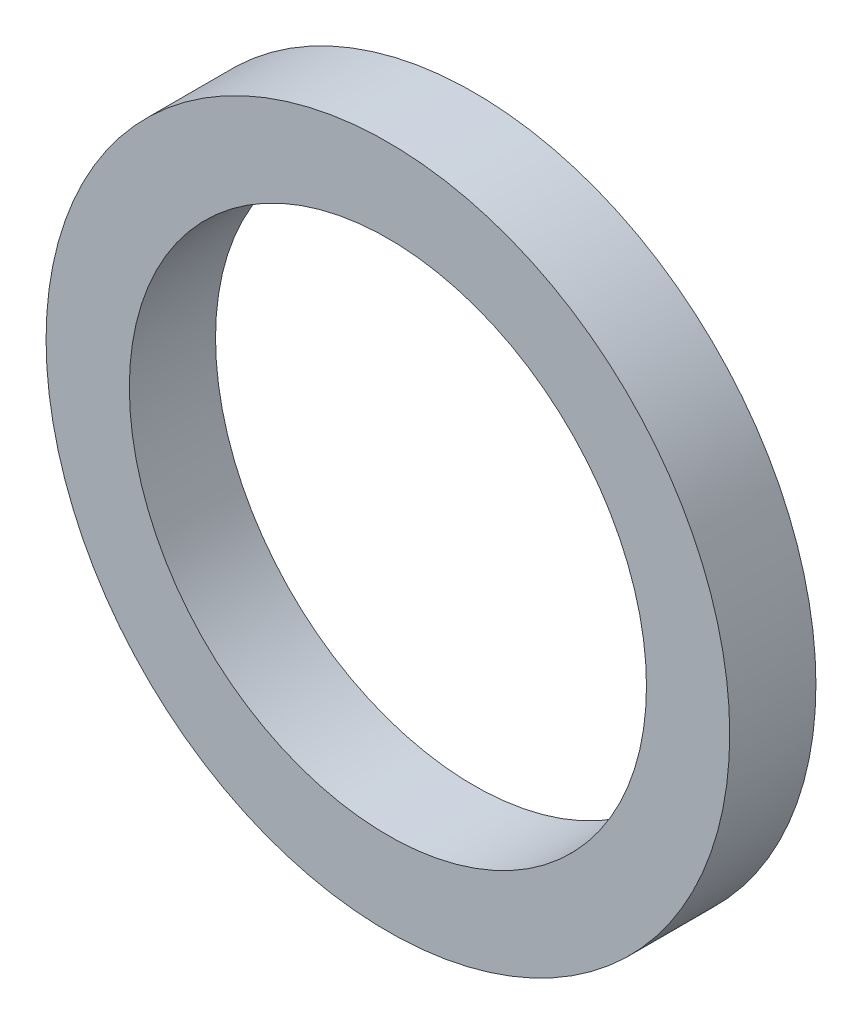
ISO-10303-21;
HEADER;
FILE_DESCRIPTION(('STEP AP214'),'2;1');
FILE_NAME('part.step','',(''),(''),'','','');
FILE_SCHEMA(('AUTOMOTIVE_DESIGN { 1 0 10303 214 1 1 1 1 }'));
ENDSEC;
DATA;
#1=APPLICATION_CONTEXT('core data for automotive mechanical design processes');
#2=APPLICATION_PROTOCOL_DEFINITION('international standard','automotive_design',2000,#1);
#3=PRODUCT_CONTEXT('',#1,'mechanical');
#4=PRODUCT('Part','Part','',(#3));
#5=PRODUCT_RELATED_PRODUCT_CATEGORY('part','',(#4));
#6=PRODUCT_DEFINITION_FORMATION('','',#4);
#7=PRODUCT_DEFINITION_CONTEXT('part definition',#1,'design');
#8=PRODUCT_DEFINITION('design','',#6,#7);
#9=PRODUCT_DEFINITION_SHAPE('','',#8);
#10=(LENGTH_UNIT() NAMED_UNIT(*) SI_UNIT(.MILLI.,.METRE.));
#11=(NAMED_UNIT(*) PLANE_ANGLE_UNIT() SI_UNIT($,.RADIAN.));
#12=(NAMED_UNIT(*) SI_UNIT($,.STERADIAN.) SOLID_ANGLE_UNIT());
#13=UNCERTAINTY_MEASURE_WITH_UNIT(LENGTH_MEASURE(1.E-05),#10,'distance_accuracy_value','');
#14=(GEOMETRIC_REPRESENTATION_CONTEXT(3) GLOBAL_UNCERTAINTY_ASSIGNED_CONTEXT((#13)) GLOBAL_UNIT_ASSIGNED_CONTEXT((#10,
#11,#12)) REPRESENTATION_CONTEXT('',''));
#15=CARTESIAN_POINT('',(0.,0.,0.));
#16=DIRECTION('',(0.,0.,1.));
#17=DIRECTION('',(1.,0.,0.));
#18=AXIS2_PLACEMENT_3D('',#15,#16,#17);
#19=CARTESIAN_POINT('',(0.,0.,6.35));
#20=DIRECTION('',(0.,0.,1.));
#21=DIRECTION('',(1.,0.,0.));
#22=AXIS2_PLACEMENT_3D('',#19,#20,#21);
#23=PLANE('',#22);
#24=CARTESIAN_POINT('',(0.,0.,6.35));
#25=DIRECTION('',(0.,0.,1.));
#26=DIRECTION('',(1.,0.,0.));
#27=AXIS2_PLACEMENT_3D('',#24,#25,#26);
#28=CIRCLE('',#27,25.1841);
#29=CARTESIAN_POINT('',(25.1841,0.,6.35));
#30=VERTEX_POINT('',#29);
#31=EDGE_CURVE('E10',#30,#30,#28,.T.);
#32=ORIENTED_EDGE('',*,*,#31,.T.);
#33=EDGE_LOOP('',(#32));
#34=FACE_BOUND('',#33,.T.);
#35=CARTESIAN_POINT('',(0.,0.,6.35));
#36=DIRECTION('',(0.,0.,1.));
#37=DIRECTION('',(1.,0.,0.));
#38=AXIS2_PLACEMENT_3D('',#35,#36,#37);
#39=CIRCLE('',#38,19.05);
#40=CARTESIAN_POINT('',(19.05,0.,6.35));
#41=VERTEX_POINT('',#40);
#42=EDGE_CURVE('E41',#41,#41,#39,.T.);
#43=ORIENTED_EDGE('',*,*,#42,.F.);
#44=EDGE_LOOP('',(#43));
#45=FACE_BOUND('',#44,.T.);
#46=ADVANCED_FACE('F30',(#34,#45),#23,.T.);
#47=CARTESIAN_POINT('',(0.,0.,0.));
#48=DIRECTION('',(0.,0.,1.));
#49=DIRECTION('',(1.,0.,0.));
#50=AXIS2_PLACEMENT_3D('',#47,#48,#49);
#51=PLANE('',#50);
#52=CARTESIAN_POINT('',(0.,0.,0.));
#53=DIRECTION('',(0.,0.,1.));
#54=DIRECTION('',(1.,0.,0.));
#55=AXIS2_PLACEMENT_3D('',#52,#53,#54);
#56=CIRCLE('',#55,25.1841);
#57=CARTESIAN_POINT('',(25.1841,0.,0.));
#58=VERTEX_POINT('',#57);
#59=EDGE_CURVE('E34',#58,#58,#56,.T.);
#60=ORIENTED_EDGE('',*,*,#59,.F.);
#61=EDGE_LOOP('',(#60));
#62=FACE_BOUND('',#61,.T.);
#63=CARTESIAN_POINT('',(0.,0.,0.));
#64=DIRECTION('',(0.,0.,1.));
#65=DIRECTION('',(1.,0.,0.));
#66=AXIS2_PLACEMENT_3D('',#63,#64,#65);
#67=CIRCLE('',#66,19.05);
#68=CARTESIAN_POINT('',(19.05,0.,0.));
#69=VERTEX_POINT('',#68);
#70=EDGE_CURVE('E43',#69,#69,#67,.T.);
#71=ORIENTED_EDGE('',*,*,#70,.T.);
#72=EDGE_LOOP('',(#71));
#73=FACE_BOUND('',#72,.T.);
#74=ADVANCED_FACE('F53',(#62,#73),#51,.F.);
#75=CARTESIAN_POINT('',(0.,0.,6.35));
#76=DIRECTION('',(0.,0.,-1.));
#77=DIRECTION('',(-1.,0.,0.));
#78=AXIS2_PLACEMENT_3D('',#75,#76,#77);
#79=CYLINDRICAL_SURFACE('',#78,25.1841);
#80=ORIENTED_EDGE('',*,*,#31,.F.);
#81=EDGE_LOOP('',(#80));
#82=FACE_BOUND('',#81,.T.);
#83=ORIENTED_EDGE('',*,*,#59,.T.);
#84=EDGE_LOOP('',(#83));
#85=FACE_BOUND('',#84,.T.);
#86=ADVANCED_FACE('F32',(#82,#85),#79,.T.);
#87=CARTESIAN_POINT('',(0.,0.,6.35));
#88=DIRECTION('',(0.,0.,-1.));
#89=DIRECTION('',(-1.,0.,0.));
#90=AXIS2_PLACEMENT_3D('',#87,#88,#89);
#91=CYLINDRICAL_SURFACE('',#90,19.05);
#92=ORIENTED_EDGE('',*,*,#42,.T.);
#93=EDGE_LOOP('',(#92));
#94=FACE_BOUND('',#93,.T.);
#95=ORIENTED_EDGE('',*,*,#70,.F.);
#96=EDGE_LOOP('',(#95));
#97=FACE_BOUND('',#96,.T.);
#98=ADVANCED_FACE('F49',(#94,#97),#91,.F.);
#99=CLOSED_SHELL('',(#46,#74,#86,#98));
#100=MANIFOLD_SOLID_BREP('B2',#99);
#101=ADVANCED_BREP_SHAPE_REPRESENTATION('',(#18,#100),#14);
#102=SHAPE_DEFINITION_REPRESENTATION(#9,#101);
ENDSEC;
END-ISO-10303-21;
